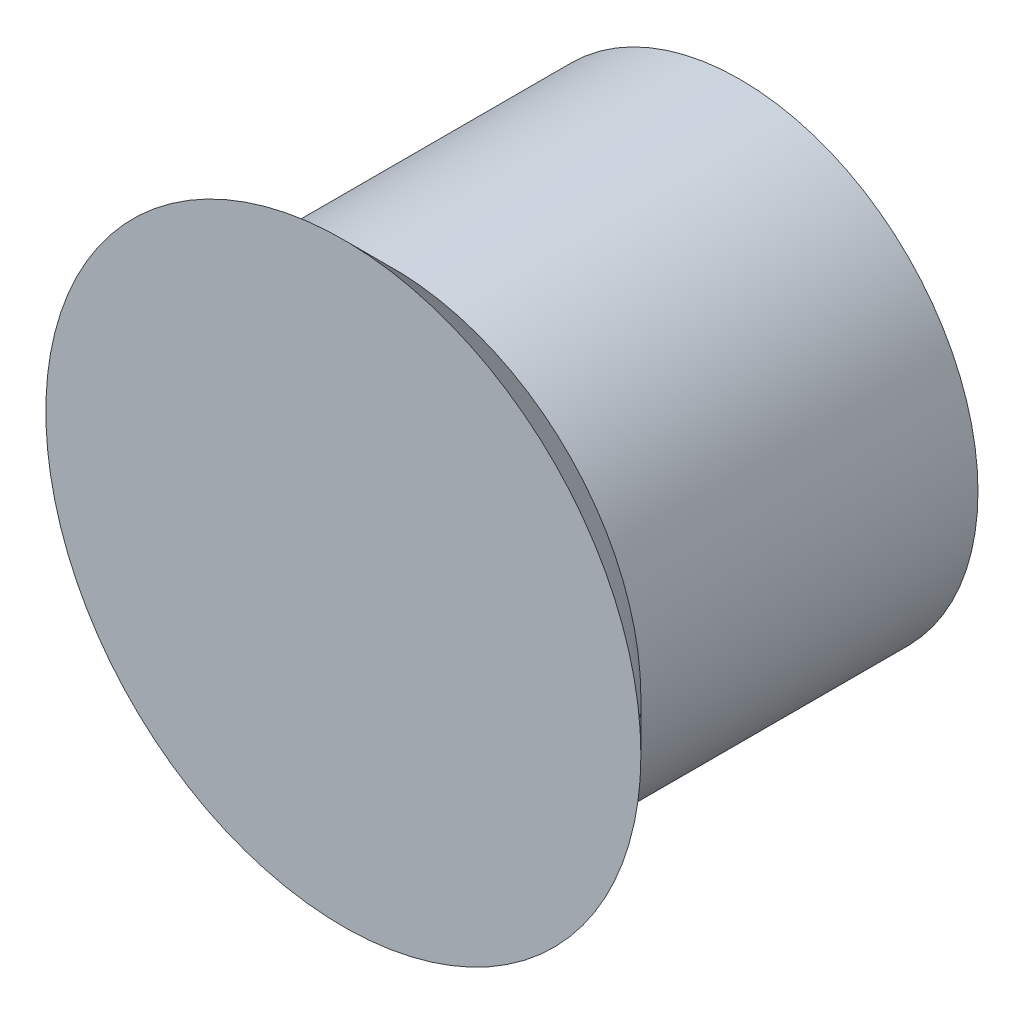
ISO-10303-21;
HEADER;
FILE_DESCRIPTION(('STEP AP214'),'2;1');
FILE_NAME('part.step','',(''),(''),'','','');
FILE_SCHEMA(('AUTOMOTIVE_DESIGN { 1 0 10303 214 1 1 1 1 }'));
ENDSEC;
DATA;
#1=APPLICATION_CONTEXT('core data for automotive mechanical design processes');
#2=APPLICATION_PROTOCOL_DEFINITION('international standard','automotive_design',2000,#1);
#3=PRODUCT_CONTEXT('',#1,'mechanical');
#4=PRODUCT('Part','Part','',(#3));
#5=PRODUCT_RELATED_PRODUCT_CATEGORY('part','',(#4));
#6=PRODUCT_DEFINITION_FORMATION('','',#4);
#7=PRODUCT_DEFINITION_CONTEXT('part definition',#1,'design');
#8=PRODUCT_DEFINITION('design','',#6,#7);
#9=PRODUCT_DEFINITION_SHAPE('','',#8);
#10=(LENGTH_UNIT() NAMED_UNIT(*) SI_UNIT(.MILLI.,.METRE.));
#11=(NAMED_UNIT(*) PLANE_ANGLE_UNIT() SI_UNIT($,.RADIAN.));
#12=(NAMED_UNIT(*) SI_UNIT($,.STERADIAN.) SOLID_ANGLE_UNIT());
#13=UNCERTAINTY_MEASURE_WITH_UNIT(LENGTH_MEASURE(1.E-05),#10,'distance_accuracy_value','');
#14=(GEOMETRIC_REPRESENTATION_CONTEXT(3) GLOBAL_UNCERTAINTY_ASSIGNED_CONTEXT((#13)) GLOBAL_UNIT_ASSIGNED_CONTEXT((#10,
#11,#12)) REPRESENTATION_CONTEXT('',''));
#15=CARTESIAN_POINT('',(0.,0.,0.));
#16=DIRECTION('',(0.,0.,1.));
#17=DIRECTION('',(1.,0.,0.));
#18=AXIS2_PLACEMENT_3D('',#15,#16,#17);
#19=CARTESIAN_POINT('',(0.,0.,3.5));
#20=DIRECTION('',(0.,0.,-1.));
#21=DIRECTION('',(-1.,0.,0.));
#22=AXIS2_PLACEMENT_3D('',#19,#20,#21);
#23=CYLINDRICAL_SURFACE('',#22,2.4);
#24=CARTESIAN_POINT('',(0.,0.,3.5));
#25=DIRECTION('',(0.,0.,1.));
#26=DIRECTION('',(1.,0.,0.));
#27=AXIS2_PLACEMENT_3D('',#24,#25,#26);
#28=CIRCLE('',#27,2.4);
#29=CARTESIAN_POINT('',(2.4,0.,3.5));
#30=VERTEX_POINT('',#29);
#31=EDGE_CURVE('E10',#30,#30,#28,.T.);
#32=ORIENTED_EDGE('',*,*,#31,.F.);
#33=EDGE_LOOP('',(#32));
#34=FACE_BOUND('',#33,.T.);
#35=CARTESIAN_POINT('',(0.,0.,0.));
#36=DIRECTION('',(0.,0.,1.));
#37=DIRECTION('',(1.,0.,0.));
#38=AXIS2_PLACEMENT_3D('',#35,#36,#37);
#39=CIRCLE('',#38,2.4);
#40=CARTESIAN_POINT('',(2.4,0.,0.));
#41=VERTEX_POINT('',#40);
#42=EDGE_CURVE('E34',#41,#41,#39,.T.);
#43=ORIENTED_EDGE('',*,*,#42,.T.);
#44=EDGE_LOOP('',(#43));
#45=FACE_BOUND('',#44,.T.);
#46=ADVANCED_FACE('F31',(#34,#45),#23,.T.);
#47=CARTESIAN_POINT('',(0.,0.,0.));
#48=DIRECTION('',(0.,0.,1.));
#49=DIRECTION('',(1.,0.,0.));
#50=AXIS2_PLACEMENT_3D('',#47,#48,#49);
#51=PLANE('',#50);
#52=ORIENTED_EDGE('',*,*,#42,.F.);
#53=EDGE_LOOP('',(#52));
#54=FACE_BOUND('',#53,.T.);
#55=ADVANCED_FACE('F62',(#54),#51,.F.);
#56=CARTESIAN_POINT('',(0.,0.,3.5));
#57=DIRECTION('',(0.,0.,1.));
#58=DIRECTION('',(1.,0.,0.));
#59=AXIS2_PLACEMENT_3D('',#56,#57,#58);
#60=CONICAL_SURFACE('',#59,2.50047153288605,0.78539816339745);
#61=CARTESIAN_POINT('',(0.,0.,4.));
#62=DIRECTION('',(0.,0.,1.));
#63=DIRECTION('',(1.,0.,0.));
#64=AXIS2_PLACEMENT_3D('',#61,#62,#63);
#65=CIRCLE('',#64,3.00047153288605);
#66=CARTESIAN_POINT('',(3.00047153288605,0.,4.));
#67=VERTEX_POINT('',#66);
#68=EDGE_CURVE('E41',#67,#67,#65,.T.);
#69=ORIENTED_EDGE('',*,*,#68,.F.);
#70=EDGE_LOOP('',(#69));
#71=FACE_BOUND('',#70,.T.);
#72=CARTESIAN_POINT('',(0.,0.,3.5));
#73=DIRECTION('',(0.,0.,1.));
#74=DIRECTION('',(1.,0.,0.));
#75=AXIS2_PLACEMENT_3D('',#72,#73,#74);
#76=CIRCLE('',#75,2.50047153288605);
#77=CARTESIAN_POINT('',(2.50047153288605,0.,3.5));
#78=VERTEX_POINT('',#77);
#79=EDGE_CURVE('E45',#78,#78,#76,.T.);
#80=ORIENTED_EDGE('',*,*,#79,.T.);
#81=EDGE_LOOP('',(#80));
#82=FACE_BOUND('',#81,.T.);
#83=ADVANCED_FACE('F49',(#71,#82),#60,.T.);
#84=CARTESIAN_POINT('',(0.,0.,4.));
#85=DIRECTION('',(0.,0.,1.));
#86=DIRECTION('',(1.,0.,0.));
#87=AXIS2_PLACEMENT_3D('',#84,#85,#86);
#88=PLANE('',#87);
#89=ORIENTED_EDGE('',*,*,#68,.T.);
#90=EDGE_LOOP('',(#89));
#91=FACE_BOUND('',#90,.T.);
#92=ADVANCED_FACE('F53',(#91),#88,.T.);
#93=CARTESIAN_POINT('',(0.,0.,3.5));
#94=DIRECTION('',(0.,0.,1.));
#95=DIRECTION('',(1.,0.,0.));
#96=AXIS2_PLACEMENT_3D('',#93,#94,#95);
#97=PLANE('',#96);
#98=ORIENTED_EDGE('',*,*,#31,.T.);
#99=EDGE_LOOP('',(#98));
#100=FACE_BOUND('',#99,.T.);
#101=ORIENTED_EDGE('',*,*,#79,.F.);
#102=EDGE_LOOP('',(#101));
#103=FACE_BOUND('',#102,.T.);
#104=ADVANCED_FACE('F51',(#100,#103),#97,.F.);
#105=CLOSED_SHELL('',(#46,#55,#83,#92,#104));
#106=MANIFOLD_SOLID_BREP('B2',#105);
#107=ADVANCED_BREP_SHAPE_REPRESENTATION('',(#18,#106),#14);
#108=SHAPE_DEFINITION_REPRESENTATION(#9,#107);
ENDSEC;
END-ISO-10303-21;
